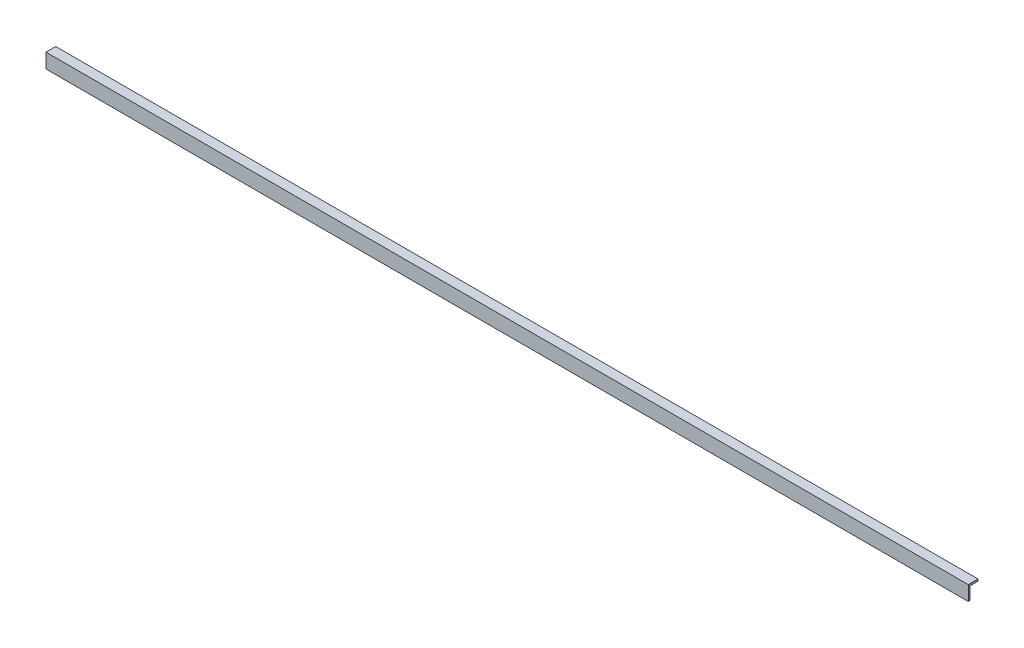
from build123d import *

# Parameters (mm, degrees)
BOSS_EXTRUDE1_DEPTH = 473.5


with BuildPart() as part:
    # Sketch1 → Boss-Extrude1 (new, symmetric)
    with BuildSketch(Plane(origin=(0, 0, 0), x_dir=(0, 0, -1), z_dir=(1, 0, 0))):
        Polygon((0, 0), (10, 0), (10, -2), (2, -2), (2, -15), (0, -15), align=None)
    extrude(amount=BOSS_EXTRUDE1_DEPTH, both=True)


solid = part.part
